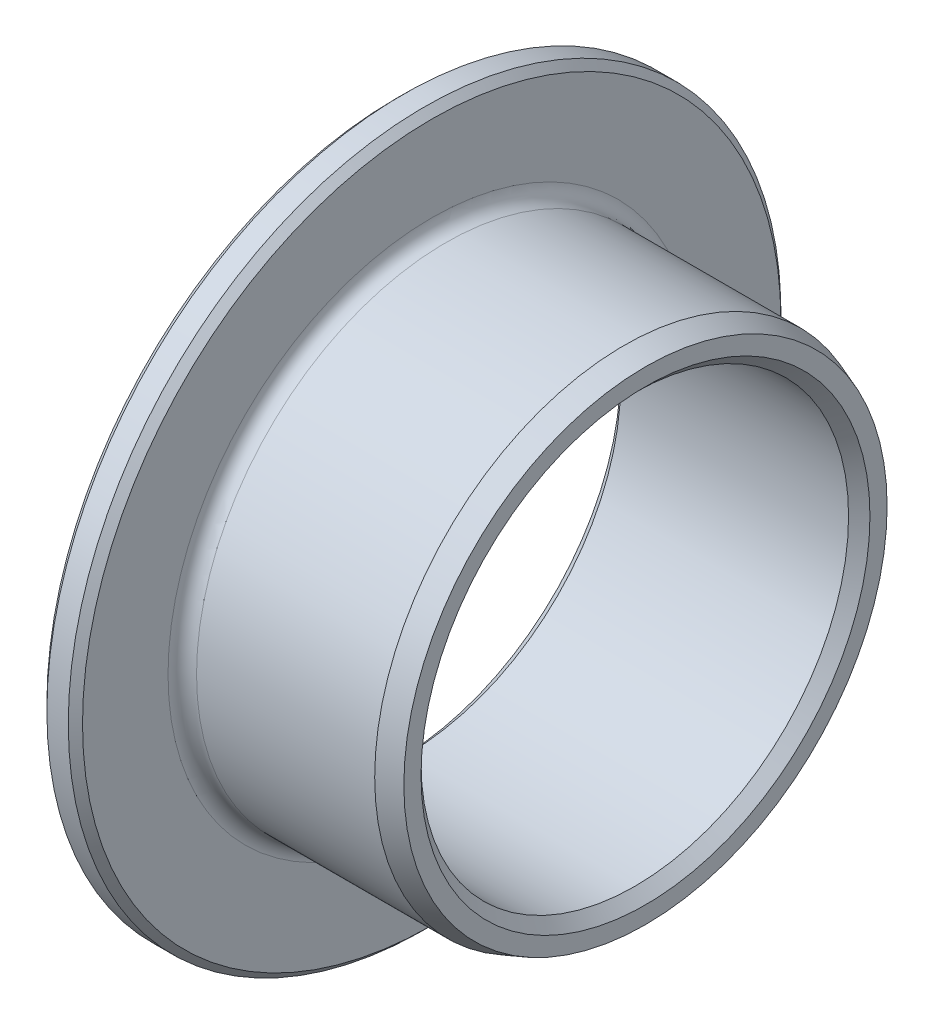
from build123d import *

# Parameters (mm, degrees)
CHANFREIN2_SIZE  = 0.6
CHANFREIN2_SIZE2 = 0.218382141
CHANFREIN3_SIZE  = 0.3
CHANFREIN4_SIZE  = 0.2
CONG_1_R         = 0.4


with BuildPart() as part:
    # Esquisse1 → Base-R_volution (revolve)
    with BuildSketch(Plane.XY, mode=Mode.PRIVATE) as base_r_volution_sk:
        Polygon((-1, 6), (-1, 10), (0, 10), (0, 7), (6, 7), (6, 6), align=None)
    revolve(base_r_volution_sk.sketch.rotate(Axis((-5.312682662, 0, 0), (1, 0, 0)), 90), axis=Axis((-5.312682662, 0, 0), (1, 0, 0)))

    # Chanfrein2
    chanfrein2_edges = [part.edges().sort_by_distance(p)[0] for p in [
        (6, 0, -7),
    ]]
    chanfrein2_side = [part.faces().sort_by_distance(p)[0] for p in [
        (3, 0, -7),
    ]]
    chamfer(chanfrein2_edges, length=CHANFREIN2_SIZE, length2=CHANFREIN2_SIZE2, reference=chanfrein2_side[0])

    # Chanfrein3
    chanfrein3_edges = [part.edges().sort_by_distance(p)[0] for p in [
        (-1, 0, -6),
        (6, 0, -6),
    ]]
    chamfer(chanfrein3_edges, length=CHANFREIN3_SIZE)

    # Chanfrein4
    chanfrein4_edges = [part.edges().sort_by_distance(p)[0] for p in [
        (0, 0, -10),
        (-1, 0, -10),
    ]]
    chamfer(chanfrein4_edges, length=CHANFREIN4_SIZE)

    # Cong_1
    cong_1_edges = [part.edges().sort_by_distance(p)[0] for p in [
        (0, 0, -7),
    ]]
    fillet(cong_1_edges, radius=CONG_1_R)


solid = part.part
